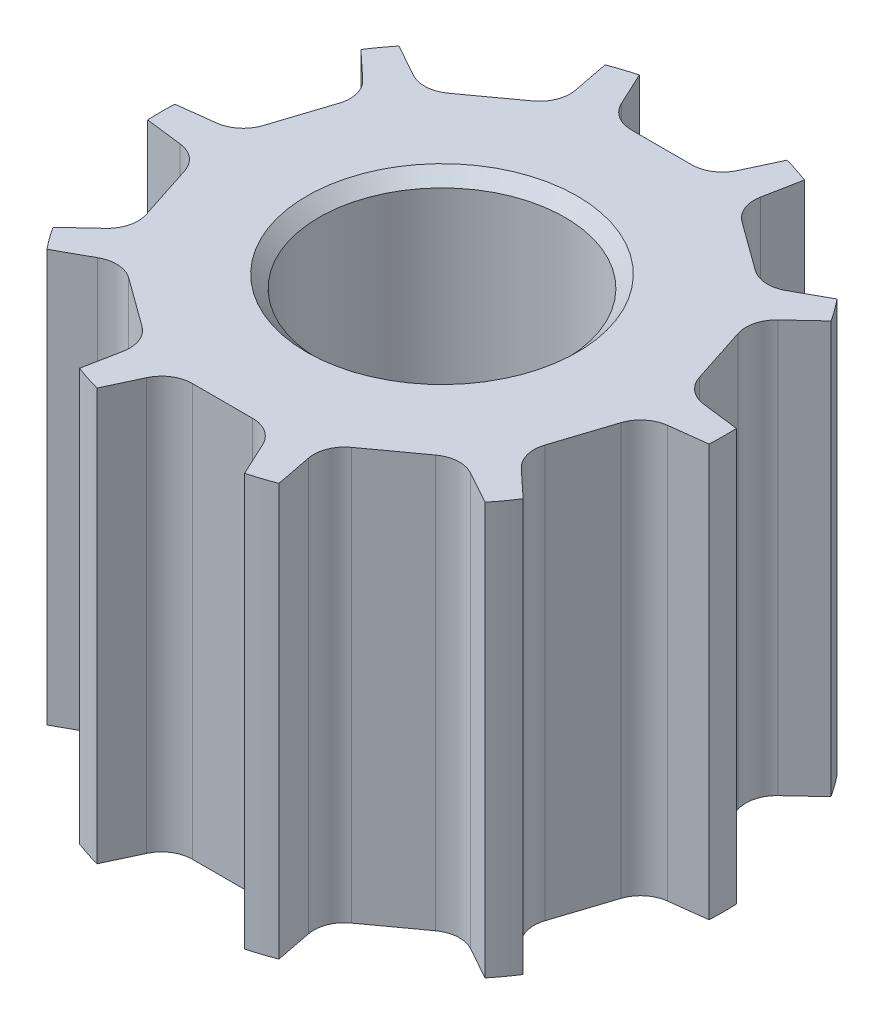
from build123d import *

# Parameters (mm, degrees)
SKIZZE1_R                       = 4.57
SKIZZE1_R_2                     = 2
AUFSATZ_LINEAR_AUSTRAGEN1_DEPTH = 6.7
SCHNITT_LINEAR_AUSTRAGEN1_DEPTH = 10.309124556
VERRUNDUNG1_R                   = 0.5
KREISMUSTER1_COUNT              = 10
VERRUNDUNG1_OF_KREISMUSTER1_R   = 0.5
FASE2_SIZE                      = 0.2


with BuildPart() as part:
    # Skizze1 → Aufsatz-Linear austragen1 (new body)
    with BuildSketch(Plane(origin=(0, 0, 0), x_dir=(1, 0, 0), z_dir=(0, 1, 0))):
        with Locations(Location((0, 0, 0), (0, 0, 270))):
            Circle(SKIZZE1_R)
        with Locations(Location((0, 0, 0), (0, 0, 270))):
            Circle(SKIZZE1_R_2, mode=Mode.SUBTRACT)
    extrude(amount=AUFSATZ_LINEAR_AUSTRAGEN1_DEPTH)

    # Skizze12 → Schnitt-Linear austragen1 (cut, through all)
    with BuildSketch(Plane(origin=(0, 6.7, 0), x_dir=(1, 0, 0), z_dir=(0, 1, 0))):
        with BuildLine():
            Line((-1.2, 4.409637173), (-0.808470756, 3.57))
            Line((-0.808470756, 3.57), (0.808470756, 3.57))
            Line((0.808470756, 3.57), (1.2, 4.409637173))
            ThreePointArc((1.2, 4.409637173), (0, 4.57), (-1.2, 4.409637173))
        make_face()
    schnitt_linear_austragen1 = extrude(amount=-SCHNITT_LINEAR_AUSTRAGEN1_DEPTH, mode=Mode.SUBTRACT)

    # Verrundung1
    verrundung1_edges = [part.edges().sort_by_distance(p)[0] for p in [
        (0.808470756, 3.35, -3.57),
        (-0.808470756, 3.35, -3.57),
    ]]
    fillet(verrundung1_edges, radius=VERRUNDUNG1_R)

    # Kreismuster1: Schnitt-Linear austragen1 ×10 about axis
    kreismuster1_axis = Axis((0, 0, 0), (0, 1, 0))
    for i in range(1, KREISMUSTER1_COUNT):
        add(schnitt_linear_austragen1.rotate(kreismuster1_axis, i * 360 / KREISMUSTER1_COUNT), mode=Mode.SUBTRACT)

    # Verrundung1 of Kreismuster1
    verrundung1_of_kreismuster1_edges = [part.edges().sort_by_distance(p)[0] for p in [
        (-1.44432677, 3.35, -3.363397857),
        (-2.752459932, 3.35, -2.412983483),
        (-3.14544056, 3.35, -1.872092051),
        (-3.645102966, 3.35, -0.334289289),
        (-3.645102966, 3.35, 0.334289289),
        (-3.14544056, 3.35, 1.872092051),
        (-2.752459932, 3.35, 2.412983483),
        (-1.44432677, 3.35, 3.363397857),
        (-0.808470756, 3.35, 3.57),
        (0.808470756, 3.35, 3.57),
        (1.44432677, 3.35, 3.363397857),
        (2.752459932, 3.35, 2.412983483),
        (3.14544056, 3.35, 1.872092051),
        (3.645102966, 3.35, 0.334289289),
        (3.645102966, 3.35, -0.334289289),
        (3.14544056, 3.35, -1.872092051),
        (2.752459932, 3.35, -2.412983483),
        (1.44432677, 3.35, -3.363397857),
    ]]
    fillet(verrundung1_of_kreismuster1_edges, radius=VERRUNDUNG1_OF_KREISMUSTER1_R)

    # Fase2
    fase2_edges = [part.edges().sort_by_distance(p)[0] for p in [
        (0, 0, -2),
        (0, 6.7, -2),
    ]]
    chamfer(fase2_edges, length=FASE2_SIZE)


solid = part.part
